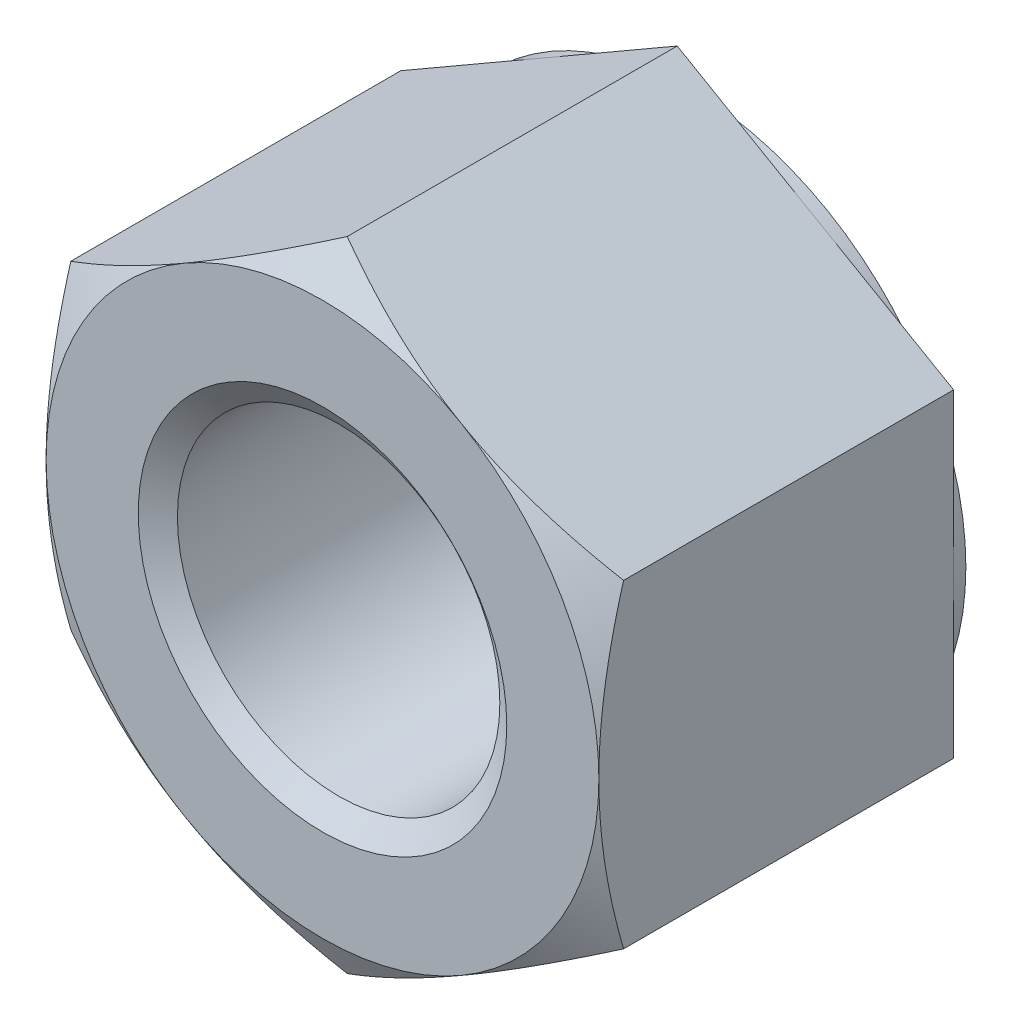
ISO-10303-21;
HEADER;
FILE_DESCRIPTION(('STEP AP214'),'2;1');
FILE_NAME('part.step','',(''),(''),'','','');
FILE_SCHEMA(('AUTOMOTIVE_DESIGN { 1 0 10303 214 1 1 1 1 }'));
ENDSEC;
DATA;
#1=APPLICATION_CONTEXT('core data for automotive mechanical design processes');
#2=APPLICATION_PROTOCOL_DEFINITION('international standard','automotive_design',2000,#1);
#3=PRODUCT_CONTEXT('',#1,'mechanical');
#4=PRODUCT('Part','Part','',(#3));
#5=PRODUCT_RELATED_PRODUCT_CATEGORY('part','',(#4));
#6=PRODUCT_DEFINITION_FORMATION('','',#4);
#7=PRODUCT_DEFINITION_CONTEXT('part definition',#1,'design');
#8=PRODUCT_DEFINITION('design','',#6,#7);
#9=PRODUCT_DEFINITION_SHAPE('','',#8);
#10=(LENGTH_UNIT() NAMED_UNIT(*) SI_UNIT(.MILLI.,.METRE.));
#11=(NAMED_UNIT(*) PLANE_ANGLE_UNIT() SI_UNIT($,.RADIAN.));
#12=(NAMED_UNIT(*) SI_UNIT($,.STERADIAN.) SOLID_ANGLE_UNIT());
#13=UNCERTAINTY_MEASURE_WITH_UNIT(LENGTH_MEASURE(1.E-05),#10,'distance_accuracy_value','');
#14=(GEOMETRIC_REPRESENTATION_CONTEXT(3) GLOBAL_UNCERTAINTY_ASSIGNED_CONTEXT((#13)) GLOBAL_UNIT_ASSIGNED_CONTEXT((#10,
#11,#12)) REPRESENTATION_CONTEXT('',''));
#15=CARTESIAN_POINT('',(0.,0.,0.));
#16=DIRECTION('',(0.,0.,1.));
#17=DIRECTION('',(1.,0.,0.));
#18=AXIS2_PLACEMENT_3D('',#15,#16,#17);
#19=CARTESIAN_POINT('',(0.,0.,-23.9));
#20=DIRECTION('',(0.,0.,1.));
#21=DIRECTION('',(1.,0.,0.));
#22=AXIS2_PLACEMENT_3D('',#19,#20,#21);
#23=CYLINDRICAL_SURFACE('',#22,10.5);
#24=CARTESIAN_POINT('',(0.,0.,-22.8496886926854));
#25=DIRECTION('',(0.,0.,1.));
#26=DIRECTION('',(1.,0.,0.));
#27=AXIS2_PLACEMENT_3D('',#24,#25,#26);
#28=CIRCLE('',#27,10.5);
#29=CARTESIAN_POINT('',(10.5,0.,-22.8496886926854));
#30=VERTEX_POINT('',#29);
#31=EDGE_CURVE('E495',#30,#30,#28,.T.);
#32=CARTESIAN_POINT('',(0.,0.,-1.05031130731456));
#33=DIRECTION('',(0.,0.,1.));
#34=DIRECTION('',(1.,0.,0.));
#35=AXIS2_PLACEMENT_3D('',#32,#33,#34);
#36=CIRCLE('',#35,10.5);
#37=CARTESIAN_POINT('',(10.5,0.,-1.05031130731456));
#38=VERTEX_POINT('',#37);
#39=EDGE_CURVE('E494',#38,#38,#36,.T.);
#40=CARTESIAN_POINT('',(10.5,0.,-22.8496886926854));
#41=CARTESIAN_POINT('',(10.5,0.,-22.6226118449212));
#42=CARTESIAN_POINT('',(10.5,0.,-22.3955349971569));
#43=CARTESIAN_POINT('',(10.5,0.,-21.9413813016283));
#44=CARTESIAN_POINT('',(10.5,0.,-21.714304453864));
#45=CARTESIAN_POINT('',(10.5,0.,-21.2601507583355));
#46=CARTESIAN_POINT('',(10.5,0.,-21.0330739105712));
#47=CARTESIAN_POINT('',(10.5,0.,-20.5789202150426));
#48=CARTESIAN_POINT('',(10.5,0.,-20.3518433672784));
#49=CARTESIAN_POINT('',(10.5,0.,-19.8976896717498));
#50=CARTESIAN_POINT('',(10.5,0.,-19.6706128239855));
#51=CARTESIAN_POINT('',(10.5,0.,-19.216459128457));
#52=CARTESIAN_POINT('',(10.5,0.,-18.9893822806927));
#53=CARTESIAN_POINT('',(10.5,0.,-18.5352285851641));
#54=CARTESIAN_POINT('',(10.5,0.,-18.3081517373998));
#55=CARTESIAN_POINT('',(10.5,0.,-17.8539980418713));
#56=CARTESIAN_POINT('',(10.5,0.,-17.626921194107));
#57=CARTESIAN_POINT('',(10.5,0.,-17.1727674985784));
#58=CARTESIAN_POINT('',(10.5,0.,-16.9456906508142));
#59=CARTESIAN_POINT('',(10.5,0.,-16.4915369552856));
#60=CARTESIAN_POINT('',(10.5,0.,-16.2644601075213));
#61=CARTESIAN_POINT('',(10.5,0.,-15.8103064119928));
#62=CARTESIAN_POINT('',(10.5,0.,-15.5832295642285));
#63=CARTESIAN_POINT('',(10.5,0.,-15.1290758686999));
#64=CARTESIAN_POINT('',(10.5,0.,-14.9019990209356));
#65=CARTESIAN_POINT('',(10.5,0.,-14.4478453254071));
#66=CARTESIAN_POINT('',(10.5,0.,-14.2207684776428));
#67=CARTESIAN_POINT('',(10.5,0.,-13.7666147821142));
#68=CARTESIAN_POINT('',(10.5,0.,-13.53953793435));
#69=CARTESIAN_POINT('',(10.5,0.,-13.0853842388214));
#70=CARTESIAN_POINT('',(10.5,0.,-12.8583073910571));
#71=CARTESIAN_POINT('',(10.5,0.,-12.4041536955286));
#72=CARTESIAN_POINT('',(10.5,0.,-12.1770768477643));
#73=CARTESIAN_POINT('',(10.5,0.,-11.7229231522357));
#74=CARTESIAN_POINT('',(10.5,0.,-11.4958463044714));
#75=CARTESIAN_POINT('',(10.5,0.,-11.0416926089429));
#76=CARTESIAN_POINT('',(10.5,0.,-10.8146157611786));
#77=CARTESIAN_POINT('',(10.5,0.,-10.36046206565));
#78=CARTESIAN_POINT('',(10.5,0.,-10.1333852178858));
#79=CARTESIAN_POINT('',(10.5,0.,-9.6792315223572));
#80=CARTESIAN_POINT('',(10.5,0.,-9.45215467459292));
#81=CARTESIAN_POINT('',(10.5,0.,-8.99800097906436));
#82=CARTESIAN_POINT('',(10.5,0.,-8.77092413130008));
#83=CARTESIAN_POINT('',(10.5,0.,-8.31677043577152));
#84=CARTESIAN_POINT('',(10.5,0.,-8.08969358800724));
#85=CARTESIAN_POINT('',(10.5,0.,-7.63553989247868));
#86=CARTESIAN_POINT('',(10.5,0.,-7.4084630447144));
#87=CARTESIAN_POINT('',(10.5,0.,-6.95430934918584));
#88=CARTESIAN_POINT('',(10.5,0.,-6.72723250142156));
#89=CARTESIAN_POINT('',(10.5,0.,-6.27307880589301));
#90=CARTESIAN_POINT('',(10.5,0.,-6.04600195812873));
#91=CARTESIAN_POINT('',(10.5,0.,-5.59184826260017));
#92=CARTESIAN_POINT('',(10.5,0.,-5.36477141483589));
#93=CARTESIAN_POINT('',(10.5,0.,-4.91061771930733));
#94=CARTESIAN_POINT('',(10.5,0.,-4.68354087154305));
#95=CARTESIAN_POINT('',(10.5,0.,-4.22938717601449));
#96=CARTESIAN_POINT('',(10.5,0.,-4.0023103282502));
#97=CARTESIAN_POINT('',(10.5,0.,-3.54815663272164));
#98=CARTESIAN_POINT('',(10.5,0.,-3.32107978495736));
#99=CARTESIAN_POINT('',(10.5,0.,-2.8669260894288));
#100=CARTESIAN_POINT('',(10.5,0.,-2.63984924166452));
#101=CARTESIAN_POINT('',(10.5,0.,-2.18569554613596));
#102=CARTESIAN_POINT('',(10.5,0.,-1.95861869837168));
#103=CARTESIAN_POINT('',(10.5,0.,-1.50446500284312));
#104=CARTESIAN_POINT('',(10.5,0.,-1.27738815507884));
#105=CARTESIAN_POINT('',(10.5,0.,-1.05031130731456));
#106=B_SPLINE_CURVE_WITH_KNOTS('',3,(#40,#41,#42,#43,#44,#45,#46,#47,#48,#49,#50,#51,#52,#53,
#54,#55,#56,#57,#58,#59,#60,#61,#62,#63,#64,#65,#66,#67,#68,#69,#70,#71,#72,#73,#74,#75,#76,#77,
#78,#79,#80,#81,#82,#83,#84,#85,#86,#87,#88,#89,#90,#91,#92,#93,#94,#95,#96,#97,#98,#99,#100,
#101,#102,#103,#104,#105),.UNSPECIFIED.,.F.,.F.,(4,2,2,2,2,2,2,2,2,2,2,2,2,2,2,2,2,2,2,2,2,2,2,
2,2,2,2,2,2,2,2,2,4),(0.,0.681230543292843,1.36246108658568,2.04369162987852,2.72492217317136,
3.4061527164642,4.08738325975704,4.76861380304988,5.44984434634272,6.13107488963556,
6.8123054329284,7.49353597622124,8.17476651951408,8.85599706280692,9.53722760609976,
10.2184581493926,10.8996886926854,11.5809192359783,12.2621497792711,12.943380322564,
13.6246108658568,14.3058414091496,14.9870719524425,15.6683024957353,16.3495330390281,
17.030763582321,17.7119941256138,18.3932246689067,19.0744552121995,19.7556857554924,
20.4369162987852,21.118146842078,21.7993773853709),.UNSPECIFIED.);
#107=EDGE_CURVE('BSEAM34',#30,#38,#106,.T.);
#108=ORIENTED_EDGE('',*,*,#31,.F.);
#109=ORIENTED_EDGE('',*,*,#39,.T.);
#110=ORIENTED_EDGE('',*,*,#107,.T.);
#111=ORIENTED_EDGE('',*,*,#107,.F.);
#112=EDGE_LOOP('',(#108,#110,#109,#111));
#113=FACE_BOUND('',#112,.T.);
#114=ADVANCED_FACE('F34',(#113),#23,.F.);
#115=CARTESIAN_POINT('',(-36.,0.,0.));
#116=DIRECTION('',(0.,0.,1.));
#117=DIRECTION('',(1.,0.,0.));
#118=AXIS2_PLACEMENT_3D('',#115,#116,#117);
#119=PLANE('',#118);
#120=CARTESIAN_POINT('',(0.,0.,0.));
#121=DIRECTION('',(0.,0.,1.));
#122=DIRECTION('',(1.,0.,0.));
#123=AXIS2_PLACEMENT_3D('',#120,#121,#122);
#124=CIRCLE('',#123,18.);
#125=CARTESIAN_POINT('',(18.,0.,0.));
#126=VERTEX_POINT('',#125);
#127=CARTESIAN_POINT('',(9.00000000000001,-15.5884572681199,0.));
#128=VERTEX_POINT('',#127);
#129=EDGE_CURVE('E12',#126,#128,#124,.F.);
#130=ORIENTED_EDGE('',*,*,#129,.F.);
#131=CARTESIAN_POINT('',(0.,0.,0.));
#132=DIRECTION('',(0.,0.,1.));
#133=DIRECTION('',(1.,0.,0.));
#134=AXIS2_PLACEMENT_3D('',#131,#132,#133);
#135=CIRCLE('',#134,18.);
#136=CARTESIAN_POINT('',(9.00000000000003,15.5884572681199,0.));
#137=VERTEX_POINT('',#136);
#138=EDGE_CURVE('E141',#126,#137,#135,.T.);
#139=ORIENTED_EDGE('',*,*,#138,.T.);
#140=CARTESIAN_POINT('',(-9.00000000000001,15.5884572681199,0.));
#141=VERTEX_POINT('',#140);
#142=EDGE_CURVE('E44',#141,#137,#124,.F.);
#143=ORIENTED_EDGE('',*,*,#142,.F.);
#144=CARTESIAN_POINT('',(-18.,0.,0.));
#145=VERTEX_POINT('',#144);
#146=EDGE_CURVE('E292',#145,#141,#124,.F.);
#147=ORIENTED_EDGE('',*,*,#146,.F.);
#148=CARTESIAN_POINT('',(-9.00000000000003,-15.5884572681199,0.));
#149=VERTEX_POINT('',#148);
#150=EDGE_CURVE('E295',#149,#145,#124,.F.);
#151=ORIENTED_EDGE('',*,*,#150,.F.);
#152=EDGE_CURVE('E43',#128,#149,#124,.F.);
#153=ORIENTED_EDGE('',*,*,#152,.F.);
#154=EDGE_LOOP('',(#130,#139,#143,#147,#151,#153));
#155=FACE_BOUND('',#154,.T.);
#156=CARTESIAN_POINT('',(0.,0.,0.));
#157=DIRECTION('',(0.,0.,1.));
#158=DIRECTION('',(1.,0.,0.));
#159=AXIS2_PLACEMENT_3D('',#156,#157,#158);
#160=CIRCLE('',#159,12.);
#161=CARTESIAN_POINT('',(12.,0.,0.));
#162=VERTEX_POINT('',#161);
#163=EDGE_CURVE('E491',#162,#162,#160,.T.);
#164=ORIENTED_EDGE('',*,*,#163,.F.);
#165=EDGE_LOOP('',(#164));
#166=FACE_BOUND('',#165,.T.);
#167=ADVANCED_FACE('F151',(#155,#166),#119,.T.);
#168=CARTESIAN_POINT('',(-36.,0.,-23.9));
#169=DIRECTION('',(0.,0.,1.));
#170=DIRECTION('',(1.,0.,0.));
#171=AXIS2_PLACEMENT_3D('',#168,#169,#170);
#172=PLANE('',#171);
#173=CARTESIAN_POINT('',(0.,0.,-23.9));
#174=DIRECTION('',(0.,0.,1.));
#175=DIRECTION('',(1.,0.,0.));
#176=AXIS2_PLACEMENT_3D('',#173,#174,#175);
#177=CIRCLE('',#176,18.);
#178=CARTESIAN_POINT('',(18.,0.,-23.9));
#179=VERTEX_POINT('',#178);
#180=EDGE_CURVE('E273',#179,#179,#177,.F.);
#181=ORIENTED_EDGE('',*,*,#180,.T.);
#182=EDGE_LOOP('',(#181));
#183=FACE_BOUND('',#182,.T.);
#184=CARTESIAN_POINT('',(0.,0.,-23.9));
#185=DIRECTION('',(0.,0.,1.));
#186=DIRECTION('',(1.,0.,0.));
#187=AXIS2_PLACEMENT_3D('',#184,#185,#186);
#188=CIRCLE('',#187,12.);
#189=CARTESIAN_POINT('',(12.,0.,-23.9));
#190=VERTEX_POINT('',#189);
#191=EDGE_CURVE('E149',#190,#190,#188,.T.);
#192=ORIENTED_EDGE('',*,*,#191,.T.);
#193=EDGE_LOOP('',(#192));
#194=FACE_BOUND('',#193,.T.);
#195=ADVANCED_FACE('F231',(#183,#194),#172,.F.);
#196=CARTESIAN_POINT('',(0.,20.7846096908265,-23.9));
#197=DIRECTION('',(-0.5,0.866025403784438,0.));
#198=DIRECTION('',(-0.866025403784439,-0.5,0.));
#199=AXIS2_PLACEMENT_3D('',#196,#197,#198);
#200=PLANE('',#199);
#201=DIRECTION('',(0.,0.,1.));
#202=VECTOR('',#201,1.);
#203=CARTESIAN_POINT('',(-18.,10.3923048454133,-23.9));
#204=LINE('',#203,#202);
#205=CARTESIAN_POINT('',(-18.,10.3923048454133,-23.1));
#206=VERTEX_POINT('',#205);
#207=CARTESIAN_POINT('',(-18.,10.3923048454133,-1.60769515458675));
#208=VERTEX_POINT('',#207);
#209=EDGE_CURVE('E282',#206,#208,#204,.T.);
#210=ORIENTED_EDGE('',*,*,#209,.T.);
#211=CARTESIAN_POINT('',(-18.0002,10.3921893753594,-1.60776182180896));
#212=CARTESIAN_POINT('',(-17.6045674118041,10.6206079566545,-1.47589336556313));
#213=CARTESIAN_POINT('',(-17.2073916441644,10.8499174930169,-1.3500088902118));
#214=CARTESIAN_POINT('',(-16.4098552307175,11.310375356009,-1.11187123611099));
#215=CARTESIAN_POINT('',(-16.0094935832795,11.5415242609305,-0.999622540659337));
#216=CARTESIAN_POINT('',(-15.2048116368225,12.0061075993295,-0.790265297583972));
#217=CARTESIAN_POINT('',(-14.8004842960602,12.2395460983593,-0.693192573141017));
#218=CARTESIAN_POINT('',(-13.9890201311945,12.7080451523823,-0.516271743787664));
#219=CARTESIAN_POINT('',(-13.5818834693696,12.9431056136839,-0.436422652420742));
#220=CARTESIAN_POINT('',(-12.7752328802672,13.4088255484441,-0.297345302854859));
#221=CARTESIAN_POINT('',(-12.3757788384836,13.6394504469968,-0.237656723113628));
#222=CARTESIAN_POINT('',(-11.5750403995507,14.1017570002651,-0.13757237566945));
#223=CARTESIAN_POINT('',(-11.1737559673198,14.3334386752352,-0.0971769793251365));
#224=CARTESIAN_POINT('',(-10.370513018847,14.7971912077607,-0.0366989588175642));
#225=CARTESIAN_POINT('',(-9.96855587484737,15.0292612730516,-0.0165921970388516));
#226=CARTESIAN_POINT('',(-9.16427056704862,15.4936156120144,0.00287614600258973));
#227=CARTESIAN_POINT('',(-8.76194241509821,15.7258998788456,0.00223836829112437));
#228=CARTESIAN_POINT('',(-8.00978065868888,16.1601606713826,-0.0183335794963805));
#229=CARTESIAN_POINT('',(-7.65989346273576,16.3621681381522,-0.0357591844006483));
#230=CARTESIAN_POINT('',(-6.96095368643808,16.765701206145,-0.08596906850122));
#231=CARTESIAN_POINT('',(-6.61190109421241,16.9672268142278,-0.118753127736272));
#232=CARTESIAN_POINT('',(-5.91476277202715,17.3697198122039,-0.199111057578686));
#233=CARTESIAN_POINT('',(-5.56667820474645,17.5706865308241,-0.246698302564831));
#234=CARTESIAN_POINT('',(-4.87216610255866,17.9716632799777,-0.355822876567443));
#235=CARTESIAN_POINT('',(-4.5257385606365,18.1716733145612,-0.417360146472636));
#236=CARTESIAN_POINT('',(-3.47411308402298,18.7788295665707,-0.624462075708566));
#237=CARTESIAN_POINT('',(-2.771960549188,19.1842175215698,-0.79067746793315));
#238=CARTESIAN_POINT('',(-1.37812528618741,19.9889486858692,-1.16791817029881));
#239=CARTESIAN_POINT('',(-0.686424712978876,20.3883021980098,-1.37885488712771));
#240=CARTESIAN_POINT('',(0.000200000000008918,20.7847251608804,-1.60776182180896));
#241=B_SPLINE_CURVE_WITH_KNOTS('',3,(#211,#212,#213,#214,#215,#216,#217,#218,#219,#220,#221,
#222,#223,#224,#225,#226,#227,#228,#229,#230,#231,#232,#233,#234,#235,#236,#237,#238,#239,#240),
.UNSPECIFIED.,.F.,.F.,(4,2,2,2,2,2,2,2,2,2,2,2,2,2,4),(0.,1.42650335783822,2.85347447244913,
4.28376471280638,5.71397301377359,7.10888071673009,8.50381526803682,9.89708828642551,
11.2903182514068,12.5031974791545,13.7160593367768,14.9300201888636,16.1439758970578,
18.6253607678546,21.1018751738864),.UNSPECIFIED.);
#242=EDGE_CURVE('E135',#208,#141,#241,.T.);
#243=ORIENTED_EDGE('',*,*,#242,.T.);
#244=CARTESIAN_POINT('',(0.,20.7846096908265,-1.60769515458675));
#245=VERTEX_POINT('',#244);
#246=EDGE_CURVE('E163',#141,#245,#241,.T.);
#247=ORIENTED_EDGE('',*,*,#246,.T.);
#248=DIRECTION('',(0.,0.,1.));
#249=VECTOR('',#248,1.);
#250=CARTESIAN_POINT('',(0.,20.7846096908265,-23.9));
#251=LINE('',#250,#249);
#252=CARTESIAN_POINT('',(0.,20.7846096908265,-23.1));
#253=VERTEX_POINT('',#252);
#254=EDGE_CURVE('E270',#253,#245,#251,.T.);
#255=ORIENTED_EDGE('',*,*,#254,.F.);
#256=DIRECTION('',(-0.866025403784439,-0.5,0.));
#257=VECTOR('',#256,1.);
#258=CARTESIAN_POINT('',(0.,20.7846096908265,-23.1));
#259=LINE('',#258,#257);
#260=CARTESIAN_POINT('',(-9.00000000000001,15.5884572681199,-23.1));
#261=VERTEX_POINT('',#260);
#262=EDGE_CURVE('E258',#253,#261,#259,.T.);
#263=ORIENTED_EDGE('',*,*,#262,.T.);
#264=EDGE_CURVE('E254',#261,#206,#259,.T.);
#265=ORIENTED_EDGE('',*,*,#264,.T.);
#266=EDGE_LOOP('',(#210,#243,#247,#255,#263,#265));
#267=FACE_BOUND('',#266,.T.);
#268=ADVANCED_FACE('F36',(#267),#200,.T.);
#269=CARTESIAN_POINT('',(18.,10.3923048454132,-23.9));
#270=DIRECTION('',(0.500000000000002,0.866025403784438,0.));
#271=DIRECTION('',(-0.866025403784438,0.500000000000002,0.));
#272=AXIS2_PLACEMENT_3D('',#269,#270,#271);
#273=PLANE('',#272);
#274=ORIENTED_EDGE('',*,*,#254,.T.);
#275=CARTESIAN_POINT('',(-0.000199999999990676,20.7847251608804,-1.60776182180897));
#276=CARTESIAN_POINT('',(0.395432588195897,20.5563065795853,-1.47589336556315));
#277=CARTESIAN_POINT('',(0.792608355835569,20.3269970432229,-1.35000889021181));
#278=CARTESIAN_POINT('',(1.59014476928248,19.8665391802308,-1.111871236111));
#279=CARTESIAN_POINT('',(1.99050641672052,19.6353902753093,-0.999622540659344));
#280=CARTESIAN_POINT('',(2.79518836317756,19.1708069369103,-0.790265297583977));
#281=CARTESIAN_POINT('',(3.1995157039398,18.9373684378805,-0.693192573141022));
#282=CARTESIAN_POINT('',(4.01097986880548,18.4688693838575,-0.51627174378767));
#283=CARTESIAN_POINT('',(4.41811653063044,18.2338089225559,-0.436422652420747));
#284=CARTESIAN_POINT('',(5.22476711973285,17.7680889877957,-0.297345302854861));
#285=CARTESIAN_POINT('',(5.62422116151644,17.537464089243,-0.237656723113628));
#286=CARTESIAN_POINT('',(6.4249596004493,17.0751575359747,-0.137572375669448));
#287=CARTESIAN_POINT('',(6.82624403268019,16.8434758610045,-0.0971769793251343));
#288=CARTESIAN_POINT('',(7.62948698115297,16.3797233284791,-0.0366989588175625));
#289=CARTESIAN_POINT('',(8.03144412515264,16.1476532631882,-0.0165921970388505));
#290=CARTESIAN_POINT('',(8.83572943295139,15.6832989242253,0.00287614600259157));
#291=CARTESIAN_POINT('',(9.2380575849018,15.4510146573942,0.00223836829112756));
#292=CARTESIAN_POINT('',(9.99021934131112,15.0167538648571,-0.0183335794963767));
#293=CARTESIAN_POINT('',(10.3401065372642,14.8147463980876,-0.035759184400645));
#294=CARTESIAN_POINT('',(11.0390463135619,14.4112133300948,-0.0859690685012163));
#295=CARTESIAN_POINT('',(11.3880989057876,14.209687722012,-0.118753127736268));
#296=CARTESIAN_POINT('',(12.0852372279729,13.8071947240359,-0.19911105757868));
#297=CARTESIAN_POINT('',(12.4333217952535,13.6062280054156,-0.246698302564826));
#298=CARTESIAN_POINT('',(13.1278338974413,13.2052512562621,-0.355822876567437));
#299=CARTESIAN_POINT('',(13.4742614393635,13.0052412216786,-0.417360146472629));
#300=CARTESIAN_POINT('',(14.525886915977,12.3980849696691,-0.624462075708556));
#301=CARTESIAN_POINT('',(15.228039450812,11.99269701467,-0.790677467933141));
#302=CARTESIAN_POINT('',(16.6218747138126,11.1879658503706,-1.1679181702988));
#303=CARTESIAN_POINT('',(17.3135752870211,10.78861233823,-1.3788548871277));
#304=CARTESIAN_POINT('',(18.0002,10.3921893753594,-1.60776182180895));
#305=B_SPLINE_CURVE_WITH_KNOTS('',3,(#275,#276,#277,#278,#279,#280,#281,#282,#283,#284,#285,
#286,#287,#288,#289,#290,#291,#292,#293,#294,#295,#296,#297,#298,#299,#300,#301,#302,#303,#304),
.UNSPECIFIED.,.F.,.F.,(4,2,2,2,2,2,2,2,2,2,2,2,2,2,4),(0.,1.42650335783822,2.85347447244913,
4.28376471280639,5.7139730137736,7.1088807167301,8.50381526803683,9.89708828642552,
11.2903182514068,12.5031974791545,13.7160593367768,14.9300201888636,16.1439758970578,
18.6253607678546,21.1018751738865),.UNSPECIFIED.);
#306=EDGE_CURVE('E159',#245,#137,#305,.T.);
#307=ORIENTED_EDGE('',*,*,#306,.T.);
#308=CARTESIAN_POINT('',(18.,10.3923048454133,-1.60769515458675));
#309=VERTEX_POINT('',#308);
#310=EDGE_CURVE('E144',#137,#309,#305,.T.);
#311=ORIENTED_EDGE('',*,*,#310,.T.);
#312=DIRECTION('',(0.,0.,1.));
#313=VECTOR('',#312,1.);
#314=CARTESIAN_POINT('',(18.,10.3923048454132,-23.9));
#315=LINE('',#314,#313);
#316=CARTESIAN_POINT('',(18.,10.3923048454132,-23.1));
#317=VERTEX_POINT('',#316);
#318=EDGE_CURVE('E158',#317,#309,#315,.T.);
#319=ORIENTED_EDGE('',*,*,#318,.F.);
#320=DIRECTION('',(-0.866025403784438,0.500000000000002,0.));
#321=VECTOR('',#320,1.);
#322=CARTESIAN_POINT('',(18.,10.3923048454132,-23.1));
#323=LINE('',#322,#321);
#324=CARTESIAN_POINT('',(9.00000000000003,15.5884572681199,-23.1));
#325=VERTEX_POINT('',#324);
#326=EDGE_CURVE('E266',#317,#325,#323,.T.);
#327=ORIENTED_EDGE('',*,*,#326,.T.);
#328=EDGE_CURVE('E262',#325,#253,#323,.T.);
#329=ORIENTED_EDGE('',*,*,#328,.T.);
#330=EDGE_LOOP('',(#274,#307,#311,#319,#327,#329));
#331=FACE_BOUND('',#330,.T.);
#332=ADVANCED_FACE('F238',(#331),#273,.T.);
#333=CARTESIAN_POINT('',(18.,10.3923048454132,-23.9));
#334=DIRECTION('',(-1.,0.,0.));
#335=DIRECTION('',(0.,0.,1.));
#336=AXIS2_PLACEMENT_3D('',#333,#334,#335);
#337=PLANE('',#336);
#338=CARTESIAN_POINT('',(18.,-27.5619239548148,-8.61348069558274));
#339=CARTESIAN_POINT('',(18.,-27.1667877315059,-8.4224777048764));
#340=CARTESIAN_POINT('',(18.,-26.7711739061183,-8.23246323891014));
#341=CARTESIAN_POINT('',(18.,-25.978890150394,-7.85463825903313));
#342=CARTESIAN_POINT('',(18.,-25.5822202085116,-7.66682776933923));
#343=CARTESIAN_POINT('',(18.,-24.3903587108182,-7.10698821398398));
#344=CARTESIAN_POINT('',(18.,-23.5934439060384,-6.73861331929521));
#345=CARTESIAN_POINT('',(18.,-21.989547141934,-6.01187832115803));
#346=CARTESIAN_POINT('',(18.,-21.1825336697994,-5.65358759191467));
#347=CARTESIAN_POINT('',(18.,-19.5618746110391,-4.95238944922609));
#348=CARTESIAN_POINT('',(18.,-18.7482293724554,-4.60948123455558));
#349=CARTESIAN_POINT('',(18.,-17.1029123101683,-3.93907746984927));
#350=CARTESIAN_POINT('',(18.,-16.2711418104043,-3.61182282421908));
#351=CARTESIAN_POINT('',(18.,-14.5977842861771,-2.98294292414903));
#352=CARTESIAN_POINT('',(18.,-13.7561961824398,-2.68132051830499));
#353=CARTESIAN_POINT('',(18.,-12.0636207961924,-2.11181367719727));
#354=CARTESIAN_POINT('',(18.,-11.2126578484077,-1.8438575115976));
#355=CARTESIAN_POINT('',(18.,-9.49855213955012,-1.35037221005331));
#356=CARTESIAN_POINT('',(18.,-8.63541331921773,-1.12482967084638));
#357=CARTESIAN_POINT('',(18.,-7.33140916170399,-0.826582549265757));
#358=CARTESIAN_POINT('',(18.,-6.89509921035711,-0.733829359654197));
#359=CARTESIAN_POINT('',(18.,-6.01957542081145,-0.563143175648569));
#360=CARTESIAN_POINT('',(18.,-5.58036164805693,-0.485209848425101));
#361=CARTESIAN_POINT('',(18.,-4.69932499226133,-0.345545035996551));
#362=CARTESIAN_POINT('',(18.,-4.25750195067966,-0.2838145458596));
#363=CARTESIAN_POINT('',(18.,-3.37175302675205,-0.177795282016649));
#364=CARTESIAN_POINT('',(18.,-2.92782714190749,-0.13350652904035));
#365=CARTESIAN_POINT('',(18.,-2.04133804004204,-0.0635630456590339));
#366=CARTESIAN_POINT('',(18.,-1.59878408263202,-0.0377917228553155));
#367=CARTESIAN_POINT('',(18.,-0.712983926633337,-0.00501858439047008));
#368=CARTESIAN_POINT('',(18.,-0.26973773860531,0.0019835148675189));
#369=CARTESIAN_POINT('',(18.,0.616528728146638,-0.00294785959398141));
#370=CARTESIAN_POINT('',(18.,1.05954903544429,-0.0148760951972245));
#371=CARTESIAN_POINT('',(18.,1.94469673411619,-0.0573715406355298));
#372=CARTESIAN_POINT('',(18.,2.3868240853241,-0.0879395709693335));
#373=CARTESIAN_POINT('',(18.,3.4580811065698,-0.183949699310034));
#374=CARTESIAN_POINT('',(18.,4.08639173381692,-0.258712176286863));
#375=CARTESIAN_POINT('',(18.,5.33809089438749,-0.441718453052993));
#376=CARTESIAN_POINT('',(18.,5.96147868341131,-0.549967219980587));
#377=CARTESIAN_POINT('',(18.,7.82534534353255,-0.919513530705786));
#378=CARTESIAN_POINT('',(18.,9.05709271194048,-1.22536507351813));
#379=CARTESIAN_POINT('',(18.,10.8995809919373,-1.75275444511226));
#380=CARTESIAN_POINT('',(18.,11.5199484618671,-1.94256699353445));
#381=CARTESIAN_POINT('',(18.,12.7546900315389,-2.3411171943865));
#382=CARTESIAN_POINT('',(18.,13.3690635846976,-2.5498565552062));
#383=CARTESIAN_POINT('',(18.,14.5887549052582,-2.98181266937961));
#384=CARTESIAN_POINT('',(18.,15.1941042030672,-3.20494114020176));
#385=CARTESIAN_POINT('',(18.,16.0983156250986,-3.54929436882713));
#386=CARTESIAN_POINT('',(18.,16.3990354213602,-3.66566915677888));
#387=CARTESIAN_POINT('',(18.,16.9993068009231,-3.90137756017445));
#388=CARTESIAN_POINT('',(18.,17.2988584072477,-4.02071111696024));
#389=CARTESIAN_POINT('',(18.,17.5978664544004,-4.14139052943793));
#390=B_SPLINE_CURVE_WITH_KNOTS('',3,(#338,#339,#340,#341,#342,#343,#344,#345,#346,#347,#348,
#349,#350,#351,#352,#353,#354,#355,#356,#357,#358,#359,#360,#361,#362,#363,#364,#365,#366,#367,
#368,#369,#370,#371,#372,#373,#374,#375,#376,#377,#378,#379,#380,#381,#382,#383,#384,#385,#386,
#387,#388,#389),.UNSPECIFIED.,.F.,.F.,(4,2,2,2,2,2,2,2,2,2,2,2,2,2,2,2,2,2,2,2,2,2,2,2,2,4),(0.,
1.3166344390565,2.63328333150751,5.26700924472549,7.91580691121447,10.5644664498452,
13.2456434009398,15.9271179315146,18.6027786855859,21.2775924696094,22.6155612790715,
23.9535000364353,25.2915209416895,26.6295434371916,27.9590656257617,29.2885677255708,
30.6177020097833,31.9468948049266,33.8440459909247,35.7414787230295,39.5436531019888,
41.4897689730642,43.436060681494,45.3713764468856,46.3387197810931,47.3060439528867),.UNSPECIFIED.);
#391=CARTESIAN_POINT('',(18.,-10.3923048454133,-1.60769515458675));
#392=VERTEX_POINT('',#391);
#393=EDGE_CURVE('E124',#392,#126,#390,.T.);
#394=ORIENTED_EDGE('',*,*,#393,.F.);
#395=DIRECTION('',(0.,0.,1.));
#396=VECTOR('',#395,1.);
#397=CARTESIAN_POINT('',(18.,-10.3923048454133,-23.9));
#398=LINE('',#397,#396);
#399=CARTESIAN_POINT('',(18.,-10.3923048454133,-23.1));
#400=VERTEX_POINT('',#399);
#401=EDGE_CURVE('E275',#400,#392,#398,.T.);
#402=ORIENTED_EDGE('',*,*,#401,.F.);
#403=DIRECTION('',(0.,-1.,0.));
#404=VECTOR('',#403,1.);
#405=CARTESIAN_POINT('',(18.,10.3923048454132,-23.1));
#406=LINE('',#405,#404);
#407=CARTESIAN_POINT('',(18.,0.,-23.1));
#408=VERTEX_POINT('',#407);
#409=EDGE_CURVE('E267',#408,#400,#406,.T.);
#410=ORIENTED_EDGE('',*,*,#409,.F.);
#411=EDGE_CURVE('E269',#317,#408,#406,.T.);
#412=ORIENTED_EDGE('',*,*,#411,.F.);
#413=ORIENTED_EDGE('',*,*,#318,.T.);
#414=EDGE_CURVE('E137',#126,#309,#390,.T.);
#415=ORIENTED_EDGE('',*,*,#414,.F.);
#416=EDGE_LOOP('',(#394,#402,#410,#412,#413,#415));
#417=FACE_BOUND('',#416,.T.);
#418=ADVANCED_FACE('F155',(#417),#337,.F.);
#419=CARTESIAN_POINT('',(0.,-20.7846096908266,-23.9));
#420=DIRECTION('',(0.500000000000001,-0.866025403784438,0.));
#421=DIRECTION('',(0.866025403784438,0.500000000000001,0.));
#422=AXIS2_PLACEMENT_3D('',#419,#420,#421);
#423=PLANE('',#422);
#424=ORIENTED_EDGE('',*,*,#401,.T.);
#425=CARTESIAN_POINT('',(18.0002,-10.3921893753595,-1.60776182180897));
#426=CARTESIAN_POINT('',(17.6045674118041,-10.6206079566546,-1.47589336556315));
#427=CARTESIAN_POINT('',(17.2073916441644,-10.8499174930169,-1.35000889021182));
#428=CARTESIAN_POINT('',(16.4098552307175,-11.310375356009,-1.11187123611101));
#429=CARTESIAN_POINT('',(16.0094935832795,-11.5415242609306,-0.999622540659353));
#430=CARTESIAN_POINT('',(15.2048116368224,-12.0061075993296,-0.790265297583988));
#431=CARTESIAN_POINT('',(14.8004842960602,-12.2395460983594,-0.693192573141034));
#432=CARTESIAN_POINT('',(13.9890201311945,-12.7080451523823,-0.516271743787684));
#433=CARTESIAN_POINT('',(13.5818834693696,-12.9431056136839,-0.436422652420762));
#434=CARTESIAN_POINT('',(12.7752328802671,-13.4088255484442,-0.29734530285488));
#435=CARTESIAN_POINT('',(12.3757788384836,-13.6394504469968,-0.23765672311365));
#436=CARTESIAN_POINT('',(11.5750403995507,-14.1017570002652,-0.137572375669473));
#437=CARTESIAN_POINT('',(11.1737559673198,-14.3334386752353,-0.0971769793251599));
#438=CARTESIAN_POINT('',(10.370513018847,-14.7971912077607,-0.0366989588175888));
#439=CARTESIAN_POINT('',(9.96855587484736,-15.0292612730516,-0.0165921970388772));
#440=CARTESIAN_POINT('',(9.16427056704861,-15.4936156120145,0.00287614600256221));
#441=CARTESIAN_POINT('',(8.76194241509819,-15.7258998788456,0.00223836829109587));
#442=CARTESIAN_POINT('',(8.00978065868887,-16.1601606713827,-0.0183335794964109));
#443=CARTESIAN_POINT('',(7.65989346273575,-16.3621681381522,-0.0357591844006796));
#444=CARTESIAN_POINT('',(6.96095368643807,-16.765701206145,-0.0859690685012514));
#445=CARTESIAN_POINT('',(6.6119010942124,-16.9672268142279,-0.118753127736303));
#446=CARTESIAN_POINT('',(5.91476277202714,-17.3697198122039,-0.199111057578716));
#447=CARTESIAN_POINT('',(5.56667820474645,-17.5706865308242,-0.246698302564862));
#448=CARTESIAN_POINT('',(4.87216610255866,-17.9716632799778,-0.355822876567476));
#449=CARTESIAN_POINT('',(4.52573856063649,-18.1716733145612,-0.417360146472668));
#450=CARTESIAN_POINT('',(3.47411308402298,-18.7788295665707,-0.624462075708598));
#451=CARTESIAN_POINT('',(2.771960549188,-19.1842175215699,-0.790677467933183));
#452=CARTESIAN_POINT('',(1.37812528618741,-19.9889486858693,-1.16791817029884));
#453=CARTESIAN_POINT('',(0.68642471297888,-20.3883021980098,-1.37885488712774));
#454=CARTESIAN_POINT('',(-0.000200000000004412,-20.7847251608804,-1.607761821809));
#455=B_SPLINE_CURVE_WITH_KNOTS('',3,(#425,#426,#427,#428,#429,#430,#431,#432,#433,#434,#435,
#436,#437,#438,#439,#440,#441,#442,#443,#444,#445,#446,#447,#448,#449,#450,#451,#452,#453,#454),
.UNSPECIFIED.,.F.,.F.,(4,2,2,2,2,2,2,2,2,2,2,2,2,2,4),(0.,1.42650335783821,2.85347447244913,
4.28376471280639,5.7139730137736,7.1088807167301,8.50381526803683,9.89708828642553,
11.2903182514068,12.5031974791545,13.7160593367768,14.9300201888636,16.1439758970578,
18.6253607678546,21.1018751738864),.UNSPECIFIED.);
#456=EDGE_CURVE('E130',#392,#128,#455,.T.);
#457=ORIENTED_EDGE('',*,*,#456,.T.);
#458=CARTESIAN_POINT('',(-1.09287578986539E-13,-20.7846096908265,-1.60769515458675));
#459=VERTEX_POINT('',#458);
#460=EDGE_CURVE('E51',#128,#459,#455,.T.);
#461=ORIENTED_EDGE('',*,*,#460,.T.);
#462=DIRECTION('',(0.,0.,1.));
#463=VECTOR('',#462,1.);
#464=CARTESIAN_POINT('',(0.,-20.7846096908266,-23.9));
#465=LINE('',#464,#463);
#466=CARTESIAN_POINT('',(0.,-20.7846096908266,-23.1));
#467=VERTEX_POINT('',#466);
#468=EDGE_CURVE('E277',#467,#459,#465,.T.);
#469=ORIENTED_EDGE('',*,*,#468,.F.);
#470=DIRECTION('',(0.866025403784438,0.500000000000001,0.));
#471=VECTOR('',#470,1.);
#472=CARTESIAN_POINT('',(0.,-20.7846096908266,-23.1));
#473=LINE('',#472,#471);
#474=CARTESIAN_POINT('',(9.00000000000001,-15.5884572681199,-23.1));
#475=VERTEX_POINT('',#474);
#476=EDGE_CURVE('E259',#467,#475,#473,.T.);
#477=ORIENTED_EDGE('',*,*,#476,.T.);
#478=EDGE_CURVE('E263',#475,#400,#473,.T.);
#479=ORIENTED_EDGE('',*,*,#478,.T.);
#480=EDGE_LOOP('',(#424,#457,#461,#469,#477,#479));
#481=FACE_BOUND('',#480,.T.);
#482=ADVANCED_FACE('F211',(#481),#423,.T.);
#483=CARTESIAN_POINT('',(-18.,-10.3923048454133,-23.9));
#484=DIRECTION('',(-0.500000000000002,-0.866025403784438,0.));
#485=DIRECTION('',(0.866025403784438,-0.500000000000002,0.));
#486=AXIS2_PLACEMENT_3D('',#483,#484,#485);
#487=PLANE('',#486);
#488=ORIENTED_EDGE('',*,*,#468,.T.);
#489=CARTESIAN_POINT('',(0.000199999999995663,-20.7847251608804,-1.607761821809));
#490=CARTESIAN_POINT('',(-0.395432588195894,-20.5563065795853,-1.47589336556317));
#491=CARTESIAN_POINT('',(-0.792608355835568,-20.326997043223,-1.35000889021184));
#492=CARTESIAN_POINT('',(-1.59014476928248,-19.8665391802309,-1.11187123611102));
#493=CARTESIAN_POINT('',(-1.99050641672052,-19.6353902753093,-0.999622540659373));
#494=CARTESIAN_POINT('',(-2.79518836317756,-19.1708069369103,-0.790265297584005));
#495=CARTESIAN_POINT('',(-3.1995157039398,-18.9373684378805,-0.69319257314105));
#496=CARTESIAN_POINT('',(-4.01097986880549,-18.4688693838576,-0.516271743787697));
#497=CARTESIAN_POINT('',(-4.41811653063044,-18.233808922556,-0.436422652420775));
#498=CARTESIAN_POINT('',(-5.22476711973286,-17.7680889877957,-0.29734530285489));
#499=CARTESIAN_POINT('',(-5.62422116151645,-17.5374640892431,-0.237656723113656));
#500=CARTESIAN_POINT('',(-6.42495960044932,-17.0751575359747,-0.137572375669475));
#501=CARTESIAN_POINT('',(-6.8262440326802,-16.8434758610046,-0.097176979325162));
#502=CARTESIAN_POINT('',(-7.62948698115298,-16.3797233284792,-0.0366989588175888));
#503=CARTESIAN_POINT('',(-8.03144412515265,-16.1476532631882,-0.0165921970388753));
#504=CARTESIAN_POINT('',(-8.83572943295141,-15.6832989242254,0.00287614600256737));
#505=CARTESIAN_POINT('',(-9.23805758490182,-15.4510146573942,0.00223836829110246));
#506=CARTESIAN_POINT('',(-9.99021934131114,-15.0167538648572,-0.0183335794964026));
#507=CARTESIAN_POINT('',(-10.3401065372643,-14.8147463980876,-0.0357591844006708));
#508=CARTESIAN_POINT('',(-11.0390463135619,-14.4112133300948,-0.0859690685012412));
#509=CARTESIAN_POINT('',(-11.3880989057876,-14.209687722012,-0.118753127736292));
#510=CARTESIAN_POINT('',(-12.0852372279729,-13.8071947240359,-0.199111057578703));
#511=CARTESIAN_POINT('',(-12.4333217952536,-13.6062280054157,-0.246698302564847));
#512=CARTESIAN_POINT('',(-13.1278338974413,-13.2052512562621,-0.355822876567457));
#513=CARTESIAN_POINT('',(-13.4742614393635,-13.0052412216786,-0.417360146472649));
#514=CARTESIAN_POINT('',(-14.525886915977,-12.3980849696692,-0.624462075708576));
#515=CARTESIAN_POINT('',(-15.228039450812,-11.99269701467,-0.790677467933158));
#516=CARTESIAN_POINT('',(-16.6218747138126,-11.1879658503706,-1.16791817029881));
#517=CARTESIAN_POINT('',(-17.3135752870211,-10.7886123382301,-1.37885488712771));
#518=CARTESIAN_POINT('',(-18.0002,-10.3921893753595,-1.60776182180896));
#519=B_SPLINE_CURVE_WITH_KNOTS('',3,(#489,#490,#491,#492,#493,#494,#495,#496,#497,#498,#499,
#500,#501,#502,#503,#504,#505,#506,#507,#508,#509,#510,#511,#512,#513,#514,#515,#516,#517,#518),
.UNSPECIFIED.,.F.,.F.,(4,2,2,2,2,2,2,2,2,2,2,2,2,2,4),(0.,1.42650335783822,2.85347447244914,
4.2837647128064,5.71397301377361,7.10888071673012,8.50381526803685,9.89708828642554,
11.2903182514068,12.5031974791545,13.7160593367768,14.9300201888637,16.1439758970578,
18.6253607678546,21.1018751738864),.UNSPECIFIED.);
#520=EDGE_CURVE('E205',#459,#149,#519,.T.);
#521=ORIENTED_EDGE('',*,*,#520,.T.);
#522=CARTESIAN_POINT('',(-18.,-10.3923048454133,-1.60769515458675));
#523=VERTEX_POINT('',#522);
#524=EDGE_CURVE('E58',#149,#523,#519,.T.);
#525=ORIENTED_EDGE('',*,*,#524,.T.);
#526=DIRECTION('',(0.,0.,1.));
#527=VECTOR('',#526,1.);
#528=CARTESIAN_POINT('',(-18.,-10.3923048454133,-23.9));
#529=LINE('',#528,#527);
#530=CARTESIAN_POINT('',(-18.,-10.3923048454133,-23.1));
#531=VERTEX_POINT('',#530);
#532=EDGE_CURVE('E280',#531,#523,#529,.T.);
#533=ORIENTED_EDGE('',*,*,#532,.F.);
#534=DIRECTION('',(0.866025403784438,-0.500000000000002,0.));
#535=VECTOR('',#534,1.);
#536=CARTESIAN_POINT('',(-18.,-10.3923048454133,-23.1));
#537=LINE('',#536,#535);
#538=CARTESIAN_POINT('',(-9.00000000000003,-15.5884572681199,-23.1));
#539=VERTEX_POINT('',#538);
#540=EDGE_CURVE('E249',#531,#539,#537,.T.);
#541=ORIENTED_EDGE('',*,*,#540,.T.);
#542=EDGE_CURVE('E255',#539,#467,#537,.T.);
#543=ORIENTED_EDGE('',*,*,#542,.T.);
#544=EDGE_LOOP('',(#488,#521,#525,#533,#541,#543));
#545=FACE_BOUND('',#544,.T.);
#546=ADVANCED_FACE('F207',(#545),#487,.T.);
#547=CARTESIAN_POINT('',(-18.,10.3923048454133,-23.9));
#548=DIRECTION('',(-1.,0.,0.));
#549=DIRECTION('',(0.,0.,1.));
#550=AXIS2_PLACEMENT_3D('',#547,#548,#549);
#551=PLANE('',#550);
#552=ORIENTED_EDGE('',*,*,#532,.T.);
#553=CARTESIAN_POINT('',(-18.,-27.5619239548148,-8.61348069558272));
#554=CARTESIAN_POINT('',(-18.,-27.1667877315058,-8.42247770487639));
#555=CARTESIAN_POINT('',(-18.,-26.7711739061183,-8.23246323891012));
#556=CARTESIAN_POINT('',(-18.,-25.978890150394,-7.85463825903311));
#557=CARTESIAN_POINT('',(-18.,-25.5822202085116,-7.66682776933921));
#558=CARTESIAN_POINT('',(-18.,-24.3903587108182,-7.10698821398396));
#559=CARTESIAN_POINT('',(-18.,-23.5934439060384,-6.73861331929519));
#560=CARTESIAN_POINT('',(-18.,-21.9895471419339,-6.01187832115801));
#561=CARTESIAN_POINT('',(-18.,-21.1825336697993,-5.65358759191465));
#562=CARTESIAN_POINT('',(-18.,-19.5618746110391,-4.95238944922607));
#563=CARTESIAN_POINT('',(-18.,-18.7482293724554,-4.60948123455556));
#564=CARTESIAN_POINT('',(-18.,-17.1029123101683,-3.93907746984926));
#565=CARTESIAN_POINT('',(-18.,-16.2711418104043,-3.61182282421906));
#566=CARTESIAN_POINT('',(-18.,-14.597784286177,-2.98294292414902));
#567=CARTESIAN_POINT('',(-18.,-13.7561961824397,-2.68132051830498));
#568=CARTESIAN_POINT('',(-18.,-12.0636207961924,-2.11181367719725));
#569=CARTESIAN_POINT('',(-18.,-11.2126578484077,-1.84385751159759));
#570=CARTESIAN_POINT('',(-18.,-9.4985521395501,-1.3503722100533));
#571=CARTESIAN_POINT('',(-18.,-8.63541331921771,-1.12482967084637));
#572=CARTESIAN_POINT('',(-18.,-7.33140916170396,-0.82658254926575));
#573=CARTESIAN_POINT('',(-18.,-6.89509921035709,-0.73382935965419));
#574=CARTESIAN_POINT('',(-18.,-6.01957542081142,-0.563143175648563));
#575=CARTESIAN_POINT('',(-18.,-5.5803616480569,-0.485209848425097));
#576=CARTESIAN_POINT('',(-18.,-4.69932499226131,-0.345545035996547));
#577=CARTESIAN_POINT('',(-18.,-4.25750195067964,-0.283814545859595));
#578=CARTESIAN_POINT('',(-18.,-3.37175302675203,-0.177795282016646));
#579=CARTESIAN_POINT('',(-18.,-2.92782714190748,-0.133506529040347));
#580=CARTESIAN_POINT('',(-18.,-2.04133804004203,-0.0635630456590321));
#581=CARTESIAN_POINT('',(-18.,-1.59878408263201,-0.0377917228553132));
#582=CARTESIAN_POINT('',(-18.,-0.712983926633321,-0.00501858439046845));
#583=CARTESIAN_POINT('',(-18.,-0.269737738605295,0.00198351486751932));
#584=CARTESIAN_POINT('',(-18.,0.616528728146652,-0.00294785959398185));
#585=CARTESIAN_POINT('',(-18.,1.05954903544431,-0.0148760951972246));
#586=CARTESIAN_POINT('',(-18.,1.94469673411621,-0.0573715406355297));
#587=CARTESIAN_POINT('',(-18.,2.38682408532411,-0.0879395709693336));
#588=CARTESIAN_POINT('',(-18.,3.45808110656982,-0.183949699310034));
#589=CARTESIAN_POINT('',(-18.,4.08639173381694,-0.258712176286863));
#590=CARTESIAN_POINT('',(-18.,5.33809089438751,-0.441718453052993));
#591=CARTESIAN_POINT('',(-18.,5.96147868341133,-0.549967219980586));
#592=CARTESIAN_POINT('',(-18.,7.82534534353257,-0.919513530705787));
#593=CARTESIAN_POINT('',(-18.,9.05709271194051,-1.22536507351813));
#594=CARTESIAN_POINT('',(-18.,10.8995809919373,-1.75275444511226));
#595=CARTESIAN_POINT('',(-18.,11.5199484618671,-1.94256699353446));
#596=CARTESIAN_POINT('',(-18.,12.7546900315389,-2.34111719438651));
#597=CARTESIAN_POINT('',(-18.,13.3690635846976,-2.5498565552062));
#598=CARTESIAN_POINT('',(-18.,14.5887549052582,-2.98181266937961));
#599=CARTESIAN_POINT('',(-18.,15.1941042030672,-3.20494114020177));
#600=CARTESIAN_POINT('',(-18.,16.0983156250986,-3.54929436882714));
#601=CARTESIAN_POINT('',(-18.,16.3990354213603,-3.66566915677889));
#602=CARTESIAN_POINT('',(-18.,16.9993068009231,-3.90137756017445));
#603=CARTESIAN_POINT('',(-18.,17.2988584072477,-4.02071111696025));
#604=CARTESIAN_POINT('',(-18.,17.5978664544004,-4.14139052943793));
#605=B_SPLINE_CURVE_WITH_KNOTS('',3,(#553,#554,#555,#556,#557,#558,#559,#560,#561,#562,#563,
#564,#565,#566,#567,#568,#569,#570,#571,#572,#573,#574,#575,#576,#577,#578,#579,#580,#581,#582,
#583,#584,#585,#586,#587,#588,#589,#590,#591,#592,#593,#594,#595,#596,#597,#598,#599,#600,#601,
#602,#603,#604),.UNSPECIFIED.,.F.,.F.,(4,2,2,2,2,2,2,2,2,2,2,2,2,2,2,2,2,2,2,2,2,2,2,2,2,4),(0.,
1.3166344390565,2.63328333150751,5.2670092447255,7.91580691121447,10.5644664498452,
13.2456434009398,15.9271179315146,18.6027786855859,21.2775924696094,22.6155612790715,
23.9535000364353,25.2915209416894,26.6295434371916,27.9590656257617,29.2885677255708,
30.6177020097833,31.9468948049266,33.8440459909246,35.7414787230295,39.5436531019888,
41.4897689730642,43.436060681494,45.3713764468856,46.338719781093,47.3060439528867),.UNSPECIFIED.);
#606=EDGE_CURVE('E206',#523,#145,#605,.T.);
#607=ORIENTED_EDGE('',*,*,#606,.T.);
#608=EDGE_CURVE('E148',#145,#208,#605,.T.);
#609=ORIENTED_EDGE('',*,*,#608,.T.);
#610=ORIENTED_EDGE('',*,*,#209,.F.);
#611=DIRECTION('',(0.,-1.,0.));
#612=VECTOR('',#611,1.);
#613=CARTESIAN_POINT('',(-18.,10.3923048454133,-23.1));
#614=LINE('',#613,#612);
#615=CARTESIAN_POINT('',(-18.,0.,-23.1));
#616=VERTEX_POINT('',#615);
#617=EDGE_CURVE('E288',#206,#616,#614,.T.);
#618=ORIENTED_EDGE('',*,*,#617,.T.);
#619=EDGE_CURVE('E286',#616,#531,#614,.T.);
#620=ORIENTED_EDGE('',*,*,#619,.T.);
#621=EDGE_LOOP('',(#552,#607,#609,#610,#618,#620));
#622=FACE_BOUND('',#621,.T.);
#623=ADVANCED_FACE('F210',(#622),#551,.T.);
#624=CARTESIAN_POINT('',(0.,30.7846096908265,-23.1));
#625=DIRECTION('',(0.,0.,-1.));
#626=DIRECTION('',(-1.,0.,0.));
#627=AXIS2_PLACEMENT_3D('',#624,#625,#626);
#628=PLANE('',#627);
#629=ORIENTED_EDGE('',*,*,#411,.T.);
#630=CARTESIAN_POINT('',(0.,0.,-23.1));
#631=DIRECTION('',(0.,0.,1.));
#632=DIRECTION('',(1.,0.,0.));
#633=AXIS2_PLACEMENT_3D('',#630,#631,#632);
#634=CIRCLE('',#633,18.);
#635=EDGE_CURVE('E246',#408,#325,#634,.T.);
#636=ORIENTED_EDGE('',*,*,#635,.T.);
#637=ORIENTED_EDGE('',*,*,#326,.F.);
#638=EDGE_LOOP('',(#629,#636,#637));
#639=FACE_BOUND('',#638,.T.);
#640=ADVANCED_FACE('F216',(#639),#628,.T.);
#641=ORIENTED_EDGE('',*,*,#409,.T.);
#642=ORIENTED_EDGE('',*,*,#478,.F.);
#643=EDGE_CURVE('E251',#475,#408,#634,.T.);
#644=ORIENTED_EDGE('',*,*,#643,.T.);
#645=EDGE_LOOP('',(#641,#642,#644));
#646=FACE_BOUND('',#645,.T.);
#647=ADVANCED_FACE('F221',(#646),#628,.T.);
#648=EDGE_CURVE('E250',#325,#261,#634,.T.);
#649=ORIENTED_EDGE('',*,*,#648,.T.);
#650=ORIENTED_EDGE('',*,*,#262,.F.);
#651=ORIENTED_EDGE('',*,*,#328,.F.);
#652=EDGE_LOOP('',(#649,#650,#651));
#653=FACE_BOUND('',#652,.T.);
#654=ADVANCED_FACE('F388',(#653),#628,.T.);
#655=ORIENTED_EDGE('',*,*,#542,.F.);
#656=EDGE_CURVE('E312',#539,#475,#634,.T.);
#657=ORIENTED_EDGE('',*,*,#656,.T.);
#658=ORIENTED_EDGE('',*,*,#476,.F.);
#659=EDGE_LOOP('',(#655,#657,#658));
#660=FACE_BOUND('',#659,.T.);
#661=ADVANCED_FACE('F379',(#660),#628,.T.);
#662=EDGE_CURVE('E505',#261,#616,#634,.T.);
#663=ORIENTED_EDGE('',*,*,#662,.T.);
#664=ORIENTED_EDGE('',*,*,#617,.F.);
#665=ORIENTED_EDGE('',*,*,#264,.F.);
#666=EDGE_LOOP('',(#663,#664,#665));
#667=FACE_BOUND('',#666,.T.);
#668=ADVANCED_FACE('F330',(#667),#628,.T.);
#669=CARTESIAN_POINT('',(0.,0.,0.));
#670=DIRECTION('',(0.,0.,1.));
#671=DIRECTION('',(1.,0.,0.));
#672=AXIS2_PLACEMENT_3D('',#669,#670,#671);
#673=CYLINDRICAL_SURFACE('',#672,18.);
#674=ORIENTED_EDGE('',*,*,#180,.F.);
#675=EDGE_LOOP('',(#674));
#676=FACE_BOUND('',#675,.T.);
#677=ORIENTED_EDGE('',*,*,#648,.F.);
#678=ORIENTED_EDGE('',*,*,#635,.F.);
#679=ORIENTED_EDGE('',*,*,#643,.F.);
#680=ORIENTED_EDGE('',*,*,#656,.F.);
#681=EDGE_CURVE('E508',#616,#539,#634,.T.);
#682=ORIENTED_EDGE('',*,*,#681,.F.);
#683=ORIENTED_EDGE('',*,*,#662,.F.);
#684=EDGE_LOOP('',(#677,#678,#679,#680,#682,#683));
#685=FACE_BOUND('',#684,.T.);
#686=ADVANCED_FACE('F190',(#676,#685),#673,.T.);
#687=ORIENTED_EDGE('',*,*,#619,.F.);
#688=ORIENTED_EDGE('',*,*,#681,.T.);
#689=ORIENTED_EDGE('',*,*,#540,.F.);
#690=EDGE_LOOP('',(#687,#688,#689));
#691=FACE_BOUND('',#690,.T.);
#692=ADVANCED_FACE('F223',(#691),#628,.T.);
#693=CARTESIAN_POINT('',(0.,0.,0.));
#694=DIRECTION('',(0.,0.,-1.));
#695=DIRECTION('',(-1.,0.,0.));
#696=AXIS2_PLACEMENT_3D('',#693,#694,#695);
#697=CONICAL_SURFACE('',#696,18.,1.0471975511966);
#698=ORIENTED_EDGE('',*,*,#138,.F.);
#699=ORIENTED_EDGE('',*,*,#414,.T.);
#700=ORIENTED_EDGE('',*,*,#310,.F.);
#701=EDGE_LOOP('',(#698,#699,#700));
#702=FACE_BOUND('',#701,.T.);
#703=ADVANCED_FACE('F142',(#702),#697,.T.);
#704=ORIENTED_EDGE('',*,*,#142,.T.);
#705=ORIENTED_EDGE('',*,*,#306,.F.);
#706=ORIENTED_EDGE('',*,*,#246,.F.);
#707=EDGE_LOOP('',(#704,#705,#706));
#708=FACE_BOUND('',#707,.T.);
#709=ADVANCED_FACE('F187',(#708),#697,.T.);
#710=ORIENTED_EDGE('',*,*,#608,.F.);
#711=ORIENTED_EDGE('',*,*,#146,.T.);
#712=ORIENTED_EDGE('',*,*,#242,.F.);
#713=EDGE_LOOP('',(#710,#711,#712));
#714=FACE_BOUND('',#713,.T.);
#715=ADVANCED_FACE('F186',(#714),#697,.T.);
#716=ORIENTED_EDGE('',*,*,#150,.T.);
#717=ORIENTED_EDGE('',*,*,#606,.F.);
#718=ORIENTED_EDGE('',*,*,#524,.F.);
#719=EDGE_LOOP('',(#716,#717,#718));
#720=FACE_BOUND('',#719,.T.);
#721=ADVANCED_FACE('F180',(#720),#697,.T.);
#722=ORIENTED_EDGE('',*,*,#152,.T.);
#723=ORIENTED_EDGE('',*,*,#520,.F.);
#724=ORIENTED_EDGE('',*,*,#460,.F.);
#725=EDGE_LOOP('',(#722,#723,#724));
#726=FACE_BOUND('',#725,.T.);
#727=ADVANCED_FACE('F185',(#726),#697,.T.);
#728=ORIENTED_EDGE('',*,*,#393,.T.);
#729=ORIENTED_EDGE('',*,*,#129,.T.);
#730=ORIENTED_EDGE('',*,*,#456,.F.);
#731=EDGE_LOOP('',(#728,#729,#730));
#732=FACE_BOUND('',#731,.T.);
#733=ADVANCED_FACE('F126',(#732),#697,.T.);
#734=CARTESIAN_POINT('',(0.,0.,-23.9));
#735=DIRECTION('',(0.,0.,-1.));
#736=DIRECTION('',(-1.,0.,0.));
#737=AXIS2_PLACEMENT_3D('',#734,#735,#736);
#738=CONICAL_SURFACE('',#737,12.,0.959931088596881);
#739=ORIENTED_EDGE('',*,*,#31,.T.);
#740=EDGE_LOOP('',(#739));
#741=FACE_BOUND('',#740,.T.);
#742=ORIENTED_EDGE('',*,*,#191,.F.);
#743=EDGE_LOOP('',(#742));
#744=FACE_BOUND('',#743,.T.);
#745=ADVANCED_FACE('F188',(#741,#744),#738,.F.);
#746=CARTESIAN_POINT('',(0.,0.,-1.05031130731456));
#747=DIRECTION('',(0.,0.,1.));
#748=DIRECTION('',(1.,0.,0.));
#749=AXIS2_PLACEMENT_3D('',#746,#747,#748);
#750=CONICAL_SURFACE('',#749,10.5,0.959931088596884);
#751=ORIENTED_EDGE('',*,*,#163,.T.);
#752=EDGE_LOOP('',(#751));
#753=FACE_BOUND('',#752,.T.);
#754=ORIENTED_EDGE('',*,*,#39,.F.);
#755=EDGE_LOOP('',(#754));
#756=FACE_BOUND('',#755,.T.);
#757=ADVANCED_FACE('F336',(#753,#756),#750,.F.);
#758=CLOSED_SHELL('',(#114,#167,#195,#268,#332,#418,#482,#546,#623,#640,#647,#654,#661,#668,
#686,#692,#703,#709,#715,#721,#727,#733,#745,#757));
#759=MANIFOLD_SOLID_BREP('B2',#758);
#760=ADVANCED_BREP_SHAPE_REPRESENTATION('',(#18,#759),#14);
#761=SHAPE_DEFINITION_REPRESENTATION(#9,#760);
ENDSEC;
END-ISO-10303-21;
